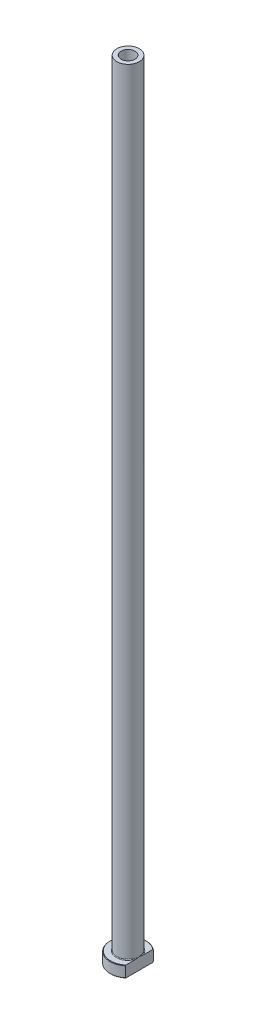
from build123d import *

# Parameters (mm, degrees)
FILLET1_R          = 0.3
CHAMFER1_SIZE      = 0.2
CUT_EXTRUDE1_DEPTH = 351.182809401
CHAMFER2_SIZE      = 0.5


with BuildPart() as part:
    # Sketch1 → Revolve1 (revolve)
    with BuildSketch(Plane.XY, mode=Mode.PRIVATE) as revolve1_sk:
        Polygon((-3.1, 350), (-5, 350), (-5, 5), (-8, 5), (-8, 0), (-3.35, 0), (-3.35, 293), (-3.1, 305), align=None)
    revolve(revolve1_sk.sketch.rotate(Axis((0, 92.187680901, 0), (0, -1, 0)), 270), axis=Axis((0, 92.187680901, 0), (0, -1, 0)))

    # Fillet1
    fillet1_edges = [part.edges().sort_by_distance(p)[0] for p in [
        (0, 5, -5),
    ]]
    fillet(fillet1_edges, radius=FILLET1_R)

    # Chamfer1
    chamfer1_edges = [part.edges().sort_by_distance(p)[0] for p in [
        (0, 0, -8),
        (0, 5, -8),
    ]]
    chamfer(chamfer1_edges, length=CHAMFER1_SIZE)

    # Sketch2 → Cut-Extrude1 (cut, through all)
    with BuildSketch(Plane.XZ):
        with BuildLine():
            Line((5, 6.244997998), (5, -6.244997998))
            ThreePointArc((5, -6.244997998), (8, 0), (5, 6.244997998))
        make_face()
    extrude(amount=-CUT_EXTRUDE1_DEPTH, mode=Mode.SUBTRACT)

    # Chamfer2
    chamfer2_edges = [part.edges().sort_by_distance(p)[0] for p in [
        (0, 0, -3.35),
    ]]
    chamfer(chamfer2_edges, length=CHAMFER2_SIZE)


solid = part.part
